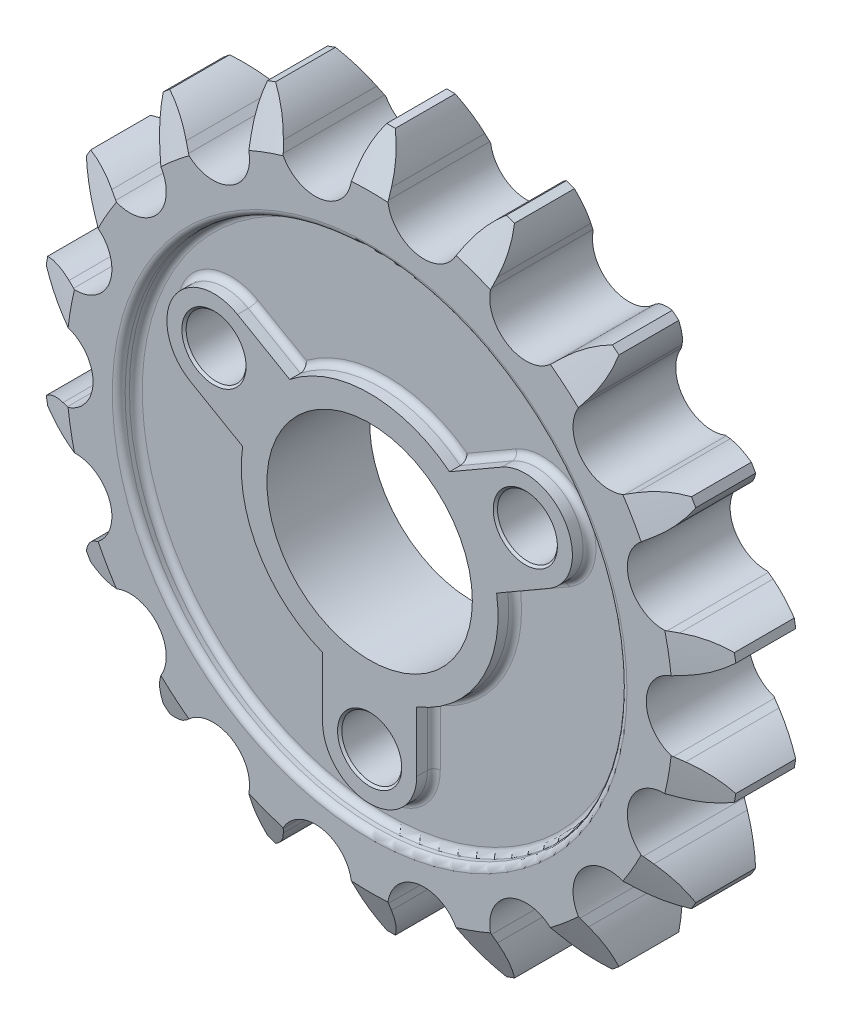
from build123d import *

# Parameters (mm, degrees)
SKETCH2_R                       = 32.313192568
BOSS_EXTRUDE1_DEPTH             = 6
BOSS_EXTRUDE2_REACH             = 48.09
BOSS_EXTRUDE2_DIRECTION_2_REACH = 48.09
CIRPATTERN1_COUNT               = 18
CUT_EXTRUDE2_START              = 6
SKETCH9_R                       = 29.313192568
CUT_EXTRUDE2_DEPTH              = 2
BOSS_EXTRUDE3_DEPTH             = 6
SKETCH11_R                      = 3.5
CUT_EXTRUDE4_DEPTH              = 58.655733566
CIRPATTERN3_COUNT               = 3
CUT_EXTRUDE3_DEPTH              = 58.655733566
CUT_EXTRUDE3_DEPTH_BACK         = 58.655733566
SKETCH7_R                       = 12
FILLET1_R                       = 0.75
CHAMFER1_SIZE                   = 0.25


with BuildPart() as part:
    # Sketch2 → Boss-Extrude1 (new, symmetric)
    with BuildSketch(Plane.XY):
        Circle(SKETCH2_R)
    extrude(amount=BOSS_EXTRUDE1_DEPTH, both=True)

    # Boss-Extrude2: up to this face of the body (flat: up to its plane)
    boss_extrude2_end = Plane(part.part.faces().sort_by_distance((0, 0, 6))[0])
    # Sketch4 → Boss-Extrude2 (add, up to the picked face)
    with BuildSketch(Plane.XY, mode=Mode.PRIVATE) as boss_extrude2_sk1:
        with BuildLine():
            Line((-0.5, 40.813134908), (0.5, 40.813134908))
            ThreePointArc((0.5, 40.813134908), (1.494248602, 38.776452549), (2.004339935, 36.568192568))
            Line((2.004339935, 36.568192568), (2.118275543, 35.568192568))
            ThreePointArc((2.118275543, 35.568192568), (3.237979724, 33.110854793), (5.611127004, 31.822282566))
            ThreePointArc((5.611127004, 31.822282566), (0, 32.313192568), (-5.611127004, 31.822282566))
            ThreePointArc((-5.611127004, 31.822282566), (-3.237979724, 33.110854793), (-2.118275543, 35.568192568))
            Line((-2.118275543, 35.568192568), (-2.004339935, 36.568192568))
            ThreePointArc((-2.004339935, 36.568192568), (-1.494248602, 38.776452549), (-0.5, 40.813134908))
        make_face()
    boss_extrude2_tool1 = split(extrude(boss_extrude2_sk1.sketch, amount=BOSS_EXTRUDE2_REACH, mode=Mode.PRIVATE), bisect_by=boss_extrude2_end, keep=Keep.BOTH, mode=Mode.PRIVATE)
    boss_extrude2 = boss_extrude2_tool1.solids().sort_by(Axis((0, 35.536475, 0), (0, 0, 1)))[0]
    add(boss_extrude2)

    # Boss-Extrude2 direction 2: up to this face of the body (flat: up to its plane)
    boss_extrude2_direction_2_end = Plane(part.part.faces().sort_by_distance((0, 0, -6))[0])
    # Sketch4 → Boss-Extrude2 direction 2 (add, up to the picked face)
    with BuildSketch(Plane.XY, mode=Mode.PRIVATE) as boss_extrude2_direction_2_sk1:
        with BuildLine():
            Line((-0.5, 40.813134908), (0.5, 40.813134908))
            ThreePointArc((0.5, 40.813134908), (1.494248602, 38.776452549), (2.004339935, 36.568192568))
            Line((2.004339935, 36.568192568), (2.118275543, 35.568192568))
            ThreePointArc((2.118275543, 35.568192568), (3.237979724, 33.110854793), (5.611127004, 31.822282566))
            ThreePointArc((5.611127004, 31.822282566), (0, 32.313192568), (-5.611127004, 31.822282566))
            ThreePointArc((-5.611127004, 31.822282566), (-3.237979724, 33.110854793), (-2.118275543, 35.568192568))
            Line((-2.118275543, 35.568192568), (-2.004339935, 36.568192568))
            ThreePointArc((-2.004339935, 36.568192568), (-1.494248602, 38.776452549), (-0.5, 40.813134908))
        make_face()
    boss_extrude2_direction_2_tool1 = split(extrude(boss_extrude2_direction_2_sk1.sketch, amount=-BOSS_EXTRUDE2_DIRECTION_2_REACH, mode=Mode.PRIVATE), bisect_by=boss_extrude2_direction_2_end, keep=Keep.BOTH, mode=Mode.PRIVATE)
    boss_extrude2_direction_2 = boss_extrude2_direction_2_tool1.solids().sort_by(Axis((0, 35.536475, 0), (0, 0, -1)))[0]
    add(boss_extrude2_direction_2)

    # CirPattern1: Boss-Extrude2, Boss-Extrude2 direction 2 ×18 about axis
    cirpattern1_axis = Axis((0, 0, 0), (0, 0, 1))
    add([boss_extrude2.rotate(cirpattern1_axis, i * 360 / CIRPATTERN1_COUNT) for i in range(1, CIRPATTERN1_COUNT)])
    add([boss_extrude2_direction_2.rotate(cirpattern1_axis, i * 360 / CIRPATTERN1_COUNT) for i in range(1, CIRPATTERN1_COUNT)])

    # Sketch5 → Cut-Revolve7 (revolve, cut)
    with BuildSketch(Plane(origin=(0, 0, 0), x_dir=(0, 0, -1), z_dir=(1, 0, 0))):
        Polygon((0, 48.313134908), (-7, 48.313134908), (-7, 33.313134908), align=None)
        Polygon((7, 48.313134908), (0, 48.313134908), (7, 33.313134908), align=None)
    revolve(axis=Axis((0, 0, 0), (0, 0, 1)), mode=Mode.SUBTRACT)

    # Sketch9 → Cut-Extrude2 (cut)
    with BuildSketch(Plane.XY.offset(CUT_EXTRUDE2_START)):
        Circle(SKETCH9_R)
    extrude(amount=-CUT_EXTRUDE2_DEPTH, mode=Mode.SUBTRACT)

    # Sketch8 → Boss-Extrude3 (add)
    with BuildSketch(Plane.XY):
        with BuildLine():
            Line((-15.436533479, 15.263139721), (-9.335631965, 11.740782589))
            ThreePointArc((-9.335631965, 11.740782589), (12.990381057, -7.5), (-14.835631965, 2.214503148))
            Line((-14.835631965, 2.214503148), (-20.936533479, 5.736860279))
            ThreePointArc((-20.936533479, 5.736860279), (-22.9496732, 13.25), (-15.436533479, 15.263139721))
        make_face()
    boss_extrude3 = extrude(amount=BOSS_EXTRUDE3_DEPTH)

    # Sketch11 → Cut-Extrude4 (cut, symmetric)
    with BuildSketch(Plane.XY):
        with Locations((-18.186533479, 10.5)):
            Circle(SKETCH11_R)
    cut_extrude4 = extrude(amount=CUT_EXTRUDE4_DEPTH, both=True, mode=Mode.SUBTRACT)

    # CirPattern3: Boss-Extrude3, Cut-Extrude4 ×3 about axis
    cirpattern3_axis = Axis((0, 0, 0), (0, 0, 1))
    add([boss_extrude3.rotate(cirpattern3_axis, i * 360 / CIRPATTERN3_COUNT) for i in range(1, CIRPATTERN3_COUNT)])
    add([cut_extrude4.rotate(cirpattern3_axis, i * 360 / CIRPATTERN3_COUNT) for i in range(1, CIRPATTERN3_COUNT)], mode=Mode.SUBTRACT)

    # Sketch7 → Cut-Extrude3 (cut, two sides: drawn at the far end of the back side and taken through both)
    with BuildSketch(Plane.XY.offset(-CUT_EXTRUDE3_DEPTH_BACK)):
        Circle(SKETCH7_R)
    extrude(amount=CUT_EXTRUDE3_DEPTH + CUT_EXTRUDE3_DEPTH_BACK, mode=Mode.SUBTRACT)

    # Fillet1
    fillet1_edges = [part.edges().sort_by_distance(p)[0] for p in [
        (-29.313192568, 0, 4),
        (-29.313192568, 0, 6),
        (-22.9496732, 13.25, 4),
        (-17.886082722, 3.975681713, 4),
        (0, 15, 4),
        (-12.386082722, 13.501961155, 4),
        (12.990381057, -7.5, 4),
        (-12.990381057, -7.5, 4),
        (22.9496732, 13.25, 4),
        (0, -26.5, 4),
        (5.5, -17.477642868, 4),
        (12.386082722, 13.501961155, 4),
        (-5.5, -17.477642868, 4),
        (17.886082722, 3.975681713, 4),
    ]]
    fillet(fillet1_edges, radius=FILLET1_R)

    # Chamfer1
    chamfer1_edges = [part.edges().sort_by_distance(p)[0] for p in [
        (-21.686533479, 10.5, -6),
        (-21.686533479, 10.5, 6),
        (1.75, -24.031088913, -6),
        (1.75, -24.031088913, 6),
        (19.936533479, 13.531088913, -6),
        (19.936533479, 13.531088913, 6),
    ]]
    chamfer(chamfer1_edges, length=CHAMFER1_SIZE)


solid = part.part
